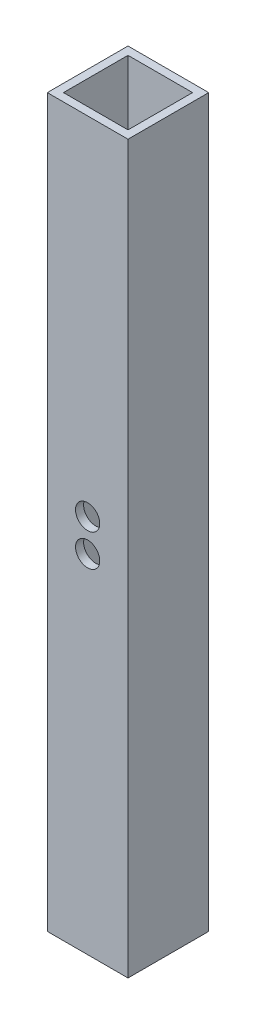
from build123d import *

# Parameters (mm, degrees)
SKETCH_1_W          = 10
SKETCH_1_H          = 10
SKETCH_1_W_2        = 8
SKETCH_1_H_2        = 8
EXTRUDE_1_DEPTH     = 90
CUT_EXTRUDE_1_REACH = 93.104
SKETCH_2_R          = 1.5


with BuildPart() as part:
    # Sketch 1 → Extrude 1 (new body)
    with BuildSketch(Plane(origin=(0, 0, 0), x_dir=(1, 0, 0), z_dir=(0, 1, 0))):
        with Locations((5, 5)):
            Rectangle(SKETCH_1_W, SKETCH_1_H)
        with Locations((5, 5)):
            Rectangle(SKETCH_1_W_2, SKETCH_1_H_2, mode=Mode.SUBTRACT)
    extrude(amount=EXTRUDE_1_DEPTH)

    # Cut-Extrude 1: up to this face of the body (flat: up to its plane)
    cut_extrude_1_end = Plane(part.part.faces().sort_by_distance((5, 45, -10))[0])
    # Sketch 2 → Cut-Extrude 1 (cut, up to the picked face)
    with BuildSketch(Plane.XY, mode=Mode.PRIVATE) as cut_extrude_1_sk1:
        with Locations((5, 47)):
            Circle(SKETCH_2_R)
    cut_extrude_1_tool1 = split(extrude(cut_extrude_1_sk1.sketch, amount=-CUT_EXTRUDE_1_REACH, mode=Mode.PRIVATE), bisect_by=cut_extrude_1_end, keep=Keep.BOTH, mode=Mode.PRIVATE)
    # Sketch 2 → Cut-Extrude 1 (cut, up to the picked face)
    with BuildSketch(Plane.XY, mode=Mode.PRIVATE) as cut_extrude_1_sk2:
        with Locations((5, 43)):
            Circle(SKETCH_2_R)
    cut_extrude_1_tool2 = split(extrude(cut_extrude_1_sk2.sketch, amount=-CUT_EXTRUDE_1_REACH, mode=Mode.PRIVATE), bisect_by=cut_extrude_1_end, keep=Keep.BOTH, mode=Mode.PRIVATE)
    add(cut_extrude_1_tool1.solids().sort_by(Axis((5, 47, 0), (0, 0, -1)))[0], mode=Mode.SUBTRACT)
    add(cut_extrude_1_tool2.solids().sort_by(Axis((5, 43, 0), (0, 0, -1)))[0], mode=Mode.SUBTRACT)


solid = part.part
